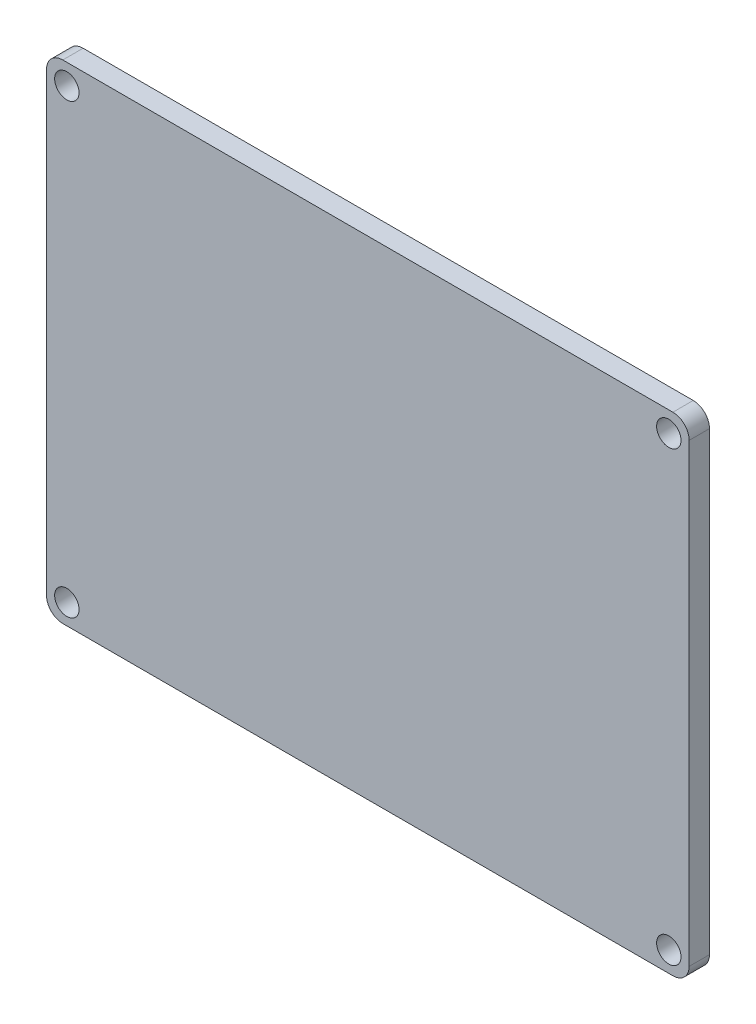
ISO-10303-21;
HEADER;
FILE_DESCRIPTION(('STEP AP214'),'2;1');
FILE_NAME('part.step','',(''),(''),'','','');
FILE_SCHEMA(('AUTOMOTIVE_DESIGN { 1 0 10303 214 1 1 1 1 }'));
ENDSEC;
DATA;
#1=APPLICATION_CONTEXT('core data for automotive mechanical design processes');
#2=APPLICATION_PROTOCOL_DEFINITION('international standard','automotive_design',2000,#1);
#3=PRODUCT_CONTEXT('',#1,'mechanical');
#4=PRODUCT('Part','Part','',(#3));
#5=PRODUCT_RELATED_PRODUCT_CATEGORY('part','',(#4));
#6=PRODUCT_DEFINITION_FORMATION('','',#4);
#7=PRODUCT_DEFINITION_CONTEXT('part definition',#1,'design');
#8=PRODUCT_DEFINITION('design','',#6,#7);
#9=PRODUCT_DEFINITION_SHAPE('','',#8);
#10=(LENGTH_UNIT() NAMED_UNIT(*) SI_UNIT(.MILLI.,.METRE.));
#11=(NAMED_UNIT(*) PLANE_ANGLE_UNIT() SI_UNIT($,.RADIAN.));
#12=(NAMED_UNIT(*) SI_UNIT($,.STERADIAN.) SOLID_ANGLE_UNIT());
#13=UNCERTAINTY_MEASURE_WITH_UNIT(LENGTH_MEASURE(1.E-05),#10,'distance_accuracy_value','');
#14=(GEOMETRIC_REPRESENTATION_CONTEXT(3) GLOBAL_UNCERTAINTY_ASSIGNED_CONTEXT((#13)) GLOBAL_UNIT_ASSIGNED_CONTEXT((#10,
#11,#12)) REPRESENTATION_CONTEXT('',''));
#15=CARTESIAN_POINT('',(0.,0.,0.));
#16=DIRECTION('',(0.,0.,1.));
#17=DIRECTION('',(1.,0.,0.));
#18=AXIS2_PLACEMENT_3D('',#15,#16,#17);
#19=CARTESIAN_POINT('',(0.,0.,3.175));
#20=DIRECTION('',(0.,0.,1.));
#21=DIRECTION('',(1.,0.,0.));
#22=AXIS2_PLACEMENT_3D('',#19,#20,#21);
#23=PLANE('',#22);
#24=CARTESIAN_POINT('',(46.99,-34.925,3.175));
#25=DIRECTION('',(0.,0.,1.));
#26=DIRECTION('',(1.,0.,0.));
#27=AXIS2_PLACEMENT_3D('',#24,#25,#26);
#28=CIRCLE('',#27,1.905);
#29=CARTESIAN_POINT('',(48.895,-34.925,3.175));
#30=VERTEX_POINT('',#29);
#31=EDGE_CURVE('E187',#30,#30,#28,.T.);
#32=ORIENTED_EDGE('',*,*,#31,.F.);
#33=EDGE_LOOP('',(#32));
#34=FACE_BOUND('',#33,.T.);
#35=CARTESIAN_POINT('',(-46.99,34.925,3.175));
#36=DIRECTION('',(0.,0.,1.));
#37=DIRECTION('',(1.,0.,0.));
#38=AXIS2_PLACEMENT_3D('',#35,#36,#37);
#39=CIRCLE('',#38,1.905);
#40=CARTESIAN_POINT('',(-45.085,34.925,3.175));
#41=VERTEX_POINT('',#40);
#42=EDGE_CURVE('E177',#41,#41,#39,.T.);
#43=ORIENTED_EDGE('',*,*,#42,.F.);
#44=EDGE_LOOP('',(#43));
#45=FACE_BOUND('',#44,.T.);
#46=DIRECTION('',(-1.,0.,0.));
#47=VECTOR('',#46,1.);
#48=CARTESIAN_POINT('',(-50.165,38.1,3.175));
#49=LINE('',#48,#47);
#50=CARTESIAN_POINT('',(47.625,38.1,3.175));
#51=VERTEX_POINT('',#50);
#52=CARTESIAN_POINT('',(-47.625,38.1,3.175));
#53=VERTEX_POINT('',#52);
#54=EDGE_CURVE('E168',#51,#53,#49,.T.);
#55=ORIENTED_EDGE('',*,*,#54,.T.);
#56=CARTESIAN_POINT('',(-47.625,35.56,3.175));
#57=DIRECTION('',(0.,0.,1.));
#58=DIRECTION('',(1.,0.,0.));
#59=AXIS2_PLACEMENT_3D('',#56,#57,#58);
#60=CIRCLE('',#59,2.54);
#61=CARTESIAN_POINT('',(-50.165,35.56,3.175));
#62=VERTEX_POINT('',#61);
#63=EDGE_CURVE('E146',#53,#62,#60,.T.);
#64=ORIENTED_EDGE('',*,*,#63,.T.);
#65=DIRECTION('',(0.,-1.,0.));
#66=VECTOR('',#65,1.);
#67=CARTESIAN_POINT('',(-50.165,38.1,3.175));
#68=LINE('',#67,#66);
#69=CARTESIAN_POINT('',(-50.165,-35.56,3.175));
#70=VERTEX_POINT('',#69);
#71=EDGE_CURVE('E116',#62,#70,#68,.T.);
#72=ORIENTED_EDGE('',*,*,#71,.T.);
#73=CARTESIAN_POINT('',(-47.625,-35.56,3.175));
#74=DIRECTION('',(0.,0.,1.));
#75=DIRECTION('',(1.,0.,0.));
#76=AXIS2_PLACEMENT_3D('',#73,#74,#75);
#77=CIRCLE('',#76,2.54);
#78=CARTESIAN_POINT('',(-47.625,-38.1,3.175));
#79=VERTEX_POINT('',#78);
#80=EDGE_CURVE('E52',#70,#79,#77,.T.);
#81=ORIENTED_EDGE('',*,*,#80,.T.);
#82=DIRECTION('',(1.,0.,0.));
#83=VECTOR('',#82,1.);
#84=CARTESIAN_POINT('',(-50.165,-38.1,3.175));
#85=LINE('',#84,#83);
#86=CARTESIAN_POINT('',(47.625,-38.1,3.175));
#87=VERTEX_POINT('',#86);
#88=EDGE_CURVE('E132',#79,#87,#85,.T.);
#89=ORIENTED_EDGE('',*,*,#88,.T.);
#90=CARTESIAN_POINT('',(47.625,-35.56,3.175));
#91=DIRECTION('',(0.,0.,1.));
#92=DIRECTION('',(1.,0.,0.));
#93=AXIS2_PLACEMENT_3D('',#90,#91,#92);
#94=CIRCLE('',#93,2.54);
#95=CARTESIAN_POINT('',(50.165,-35.56,3.175));
#96=VERTEX_POINT('',#95);
#97=EDGE_CURVE('E142',#87,#96,#94,.T.);
#98=ORIENTED_EDGE('',*,*,#97,.T.);
#99=DIRECTION('',(0.,1.,0.));
#100=VECTOR('',#99,1.);
#101=CARTESIAN_POINT('',(50.165,38.1,3.175));
#102=LINE('',#101,#100);
#103=CARTESIAN_POINT('',(50.165,35.56,3.175));
#104=VERTEX_POINT('',#103);
#105=EDGE_CURVE('E126',#96,#104,#102,.T.);
#106=ORIENTED_EDGE('',*,*,#105,.T.);
#107=CARTESIAN_POINT('',(47.625,35.56,3.175));
#108=DIRECTION('',(0.,0.,1.));
#109=DIRECTION('',(1.,0.,0.));
#110=AXIS2_PLACEMENT_3D('',#107,#108,#109);
#111=CIRCLE('',#110,2.54);
#112=EDGE_CURVE('E144',#104,#51,#111,.T.);
#113=ORIENTED_EDGE('',*,*,#112,.T.);
#114=EDGE_LOOP('',(#55,#64,#72,#81,#89,#98,#106,#113));
#115=FACE_BOUND('',#114,.T.);
#116=CARTESIAN_POINT('',(-46.99,-34.925,3.175));
#117=DIRECTION('',(0.,0.,1.));
#118=DIRECTION('',(-1.,0.,0.));
#119=AXIS2_PLACEMENT_3D('',#116,#117,#118);
#120=CIRCLE('',#119,1.905);
#121=CARTESIAN_POINT('',(-48.895,-34.925,3.175));
#122=VERTEX_POINT('',#121);
#123=EDGE_CURVE('E182',#122,#122,#120,.T.);
#124=ORIENTED_EDGE('',*,*,#123,.F.);
#125=EDGE_LOOP('',(#124));
#126=FACE_BOUND('',#125,.T.);
#127=CARTESIAN_POINT('',(46.99,34.9249999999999,3.175));
#128=DIRECTION('',(0.,0.,1.));
#129=DIRECTION('',(-1.,0.,0.));
#130=AXIS2_PLACEMENT_3D('',#127,#128,#129);
#131=CIRCLE('',#130,1.905);
#132=CARTESIAN_POINT('',(45.085,34.9249999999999,3.175));
#133=VERTEX_POINT('',#132);
#134=EDGE_CURVE('E193',#133,#133,#131,.T.);
#135=ORIENTED_EDGE('',*,*,#134,.F.);
#136=EDGE_LOOP('',(#135));
#137=FACE_BOUND('',#136,.T.);
#138=ADVANCED_FACE('F32',(#34,#45,#115,#126,#137),#23,.T.);
#139=CARTESIAN_POINT('',(0.,0.,0.));
#140=DIRECTION('',(0.,0.,1.));
#141=DIRECTION('',(1.,0.,0.));
#142=AXIS2_PLACEMENT_3D('',#139,#140,#141);
#143=PLANE('',#142);
#144=DIRECTION('',(0.,-1.,0.));
#145=VECTOR('',#144,1.);
#146=CARTESIAN_POINT('',(-50.165,38.1,0.));
#147=LINE('',#146,#145);
#148=CARTESIAN_POINT('',(-50.165,35.56,0.));
#149=VERTEX_POINT('',#148);
#150=CARTESIAN_POINT('',(-50.165,-35.56,0.));
#151=VERTEX_POINT('',#150);
#152=EDGE_CURVE('E114',#149,#151,#147,.T.);
#153=ORIENTED_EDGE('',*,*,#152,.F.);
#154=CARTESIAN_POINT('',(-47.625,35.56,0.));
#155=DIRECTION('',(0.,0.,1.));
#156=DIRECTION('',(1.,0.,0.));
#157=AXIS2_PLACEMENT_3D('',#154,#155,#156);
#158=CIRCLE('',#157,2.54);
#159=CARTESIAN_POINT('',(-47.625,38.1,0.));
#160=VERTEX_POINT('',#159);
#161=EDGE_CURVE('E97',#149,#160,#158,.F.);
#162=ORIENTED_EDGE('',*,*,#161,.T.);
#163=DIRECTION('',(-1.,0.,0.));
#164=VECTOR('',#163,1.);
#165=CARTESIAN_POINT('',(-50.165,38.1,0.));
#166=LINE('',#165,#164);
#167=CARTESIAN_POINT('',(47.625,38.1,0.));
#168=VERTEX_POINT('',#167);
#169=EDGE_CURVE('E124',#168,#160,#166,.T.);
#170=ORIENTED_EDGE('',*,*,#169,.F.);
#171=CARTESIAN_POINT('',(47.625,35.56,0.));
#172=DIRECTION('',(0.,0.,1.));
#173=DIRECTION('',(1.,0.,0.));
#174=AXIS2_PLACEMENT_3D('',#171,#172,#173);
#175=CIRCLE('',#174,2.54);
#176=CARTESIAN_POINT('',(50.165,35.56,0.));
#177=VERTEX_POINT('',#176);
#178=EDGE_CURVE('E108',#168,#177,#175,.F.);
#179=ORIENTED_EDGE('',*,*,#178,.T.);
#180=DIRECTION('',(0.,1.,0.));
#181=VECTOR('',#180,1.);
#182=CARTESIAN_POINT('',(50.165,38.1,0.));
#183=LINE('',#182,#181);
#184=CARTESIAN_POINT('',(50.165,-35.56,0.));
#185=VERTEX_POINT('',#184);
#186=EDGE_CURVE('E128',#185,#177,#183,.T.);
#187=ORIENTED_EDGE('',*,*,#186,.F.);
#188=CARTESIAN_POINT('',(47.625,-35.56,0.));
#189=DIRECTION('',(0.,0.,1.));
#190=DIRECTION('',(1.,0.,0.));
#191=AXIS2_PLACEMENT_3D('',#188,#189,#190);
#192=CIRCLE('',#191,2.54);
#193=CARTESIAN_POINT('',(47.625,-38.1,0.));
#194=VERTEX_POINT('',#193);
#195=EDGE_CURVE('E135',#185,#194,#192,.F.);
#196=ORIENTED_EDGE('',*,*,#195,.T.);
#197=DIRECTION('',(1.,0.,0.));
#198=VECTOR('',#197,1.);
#199=CARTESIAN_POINT('',(-50.165,-38.1,0.));
#200=LINE('',#199,#198);
#201=CARTESIAN_POINT('',(-47.625,-38.1,0.));
#202=VERTEX_POINT('',#201);
#203=EDGE_CURVE('E123',#202,#194,#200,.T.);
#204=ORIENTED_EDGE('',*,*,#203,.F.);
#205=CARTESIAN_POINT('',(-47.625,-35.56,0.));
#206=DIRECTION('',(0.,0.,1.));
#207=DIRECTION('',(1.,0.,0.));
#208=AXIS2_PLACEMENT_3D('',#205,#206,#207);
#209=CIRCLE('',#208,2.54);
#210=EDGE_CURVE('E117',#202,#151,#209,.F.);
#211=ORIENTED_EDGE('',*,*,#210,.T.);
#212=EDGE_LOOP('',(#153,#162,#170,#179,#187,#196,#204,#211));
#213=FACE_BOUND('',#212,.T.);
#214=CARTESIAN_POINT('',(-46.99,34.925,0.));
#215=DIRECTION('',(0.,0.,1.));
#216=DIRECTION('',(1.,0.,0.));
#217=AXIS2_PLACEMENT_3D('',#214,#215,#216);
#218=CIRCLE('',#217,1.905);
#219=CARTESIAN_POINT('',(-45.085,34.925,0.));
#220=VERTEX_POINT('',#219);
#221=EDGE_CURVE('E173',#220,#220,#218,.T.);
#222=ORIENTED_EDGE('',*,*,#221,.T.);
#223=EDGE_LOOP('',(#222));
#224=FACE_BOUND('',#223,.T.);
#225=CARTESIAN_POINT('',(-46.99,-34.925,0.));
#226=DIRECTION('',(0.,0.,1.));
#227=DIRECTION('',(-1.,0.,0.));
#228=AXIS2_PLACEMENT_3D('',#225,#226,#227);
#229=CIRCLE('',#228,1.905);
#230=CARTESIAN_POINT('',(-48.895,-34.925,0.));
#231=VERTEX_POINT('',#230);
#232=EDGE_CURVE('E184',#231,#231,#229,.T.);
#233=ORIENTED_EDGE('',*,*,#232,.T.);
#234=EDGE_LOOP('',(#233));
#235=FACE_BOUND('',#234,.T.);
#236=CARTESIAN_POINT('',(46.99,-34.925,0.));
#237=DIRECTION('',(0.,0.,1.));
#238=DIRECTION('',(1.,0.,0.));
#239=AXIS2_PLACEMENT_3D('',#236,#237,#238);
#240=CIRCLE('',#239,1.905);
#241=CARTESIAN_POINT('',(48.895,-34.925,0.));
#242=VERTEX_POINT('',#241);
#243=EDGE_CURVE('E190',#242,#242,#240,.T.);
#244=ORIENTED_EDGE('',*,*,#243,.T.);
#245=EDGE_LOOP('',(#244));
#246=FACE_BOUND('',#245,.T.);
#247=CARTESIAN_POINT('',(46.99,34.9249999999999,0.));
#248=DIRECTION('',(0.,0.,1.));
#249=DIRECTION('',(-1.,0.,0.));
#250=AXIS2_PLACEMENT_3D('',#247,#248,#249);
#251=CIRCLE('',#250,1.905);
#252=CARTESIAN_POINT('',(45.085,34.9249999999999,0.));
#253=VERTEX_POINT('',#252);
#254=EDGE_CURVE('E196',#253,#253,#251,.T.);
#255=ORIENTED_EDGE('',*,*,#254,.T.);
#256=EDGE_LOOP('',(#255));
#257=FACE_BOUND('',#256,.T.);
#258=ADVANCED_FACE('F120',(#213,#224,#235,#246,#257),#143,.F.);
#259=CARTESIAN_POINT('',(50.165,38.1,3.175));
#260=DIRECTION('',(-1.,0.,0.));
#261=DIRECTION('',(0.,-1.,0.));
#262=AXIS2_PLACEMENT_3D('',#259,#260,#261);
#263=PLANE('',#262);
#264=ORIENTED_EDGE('',*,*,#186,.T.);
#265=DIRECTION('',(0.,0.,-1.));
#266=VECTOR('',#265,1.);
#267=CARTESIAN_POINT('',(50.165,35.56,3.175));
#268=LINE('',#267,#266);
#269=EDGE_CURVE('E151',#177,#104,#268,.F.);
#270=ORIENTED_EDGE('',*,*,#269,.T.);
#271=ORIENTED_EDGE('',*,*,#105,.F.);
#272=DIRECTION('',(0.,0.,-1.));
#273=VECTOR('',#272,1.);
#274=CARTESIAN_POINT('',(50.165,-35.56,3.175));
#275=LINE('',#274,#273);
#276=EDGE_CURVE('E148',#96,#185,#275,.T.);
#277=ORIENTED_EDGE('',*,*,#276,.T.);
#278=EDGE_LOOP('',(#264,#270,#271,#277));
#279=FACE_BOUND('',#278,.T.);
#280=ADVANCED_FACE('F164',(#279),#263,.F.);
#281=CARTESIAN_POINT('',(-50.165,38.1,3.175));
#282=DIRECTION('',(0.,-1.,0.));
#283=DIRECTION('',(0.,0.,-1.));
#284=AXIS2_PLACEMENT_3D('',#281,#282,#283);
#285=PLANE('',#284);
#286=ORIENTED_EDGE('',*,*,#169,.T.);
#287=DIRECTION('',(0.,0.,-1.));
#288=VECTOR('',#287,1.);
#289=CARTESIAN_POINT('',(-47.625,38.1,3.175));
#290=LINE('',#289,#288);
#291=EDGE_CURVE('E102',#160,#53,#290,.F.);
#292=ORIENTED_EDGE('',*,*,#291,.T.);
#293=ORIENTED_EDGE('',*,*,#54,.F.);
#294=DIRECTION('',(0.,0.,-1.));
#295=VECTOR('',#294,1.);
#296=CARTESIAN_POINT('',(47.625,38.1,3.175));
#297=LINE('',#296,#295);
#298=EDGE_CURVE('E107',#51,#168,#297,.T.);
#299=ORIENTED_EDGE('',*,*,#298,.T.);
#300=EDGE_LOOP('',(#286,#292,#293,#299));
#301=FACE_BOUND('',#300,.T.);
#302=ADVANCED_FACE('F222',(#301),#285,.F.);
#303=CARTESIAN_POINT('',(-50.165,38.1,3.175));
#304=DIRECTION('',(1.,0.,0.));
#305=DIRECTION('',(0.,0.,-1.));
#306=AXIS2_PLACEMENT_3D('',#303,#304,#305);
#307=PLANE('',#306);
#308=ORIENTED_EDGE('',*,*,#71,.F.);
#309=DIRECTION('',(0.,0.,-1.));
#310=VECTOR('',#309,1.);
#311=CARTESIAN_POINT('',(-50.165,35.56,3.175));
#312=LINE('',#311,#310);
#313=EDGE_CURVE('E101',#62,#149,#312,.T.);
#314=ORIENTED_EDGE('',*,*,#313,.T.);
#315=ORIENTED_EDGE('',*,*,#152,.T.);
#316=DIRECTION('',(0.,0.,-1.));
#317=VECTOR('',#316,1.);
#318=CARTESIAN_POINT('',(-50.165,-35.56,3.175));
#319=LINE('',#318,#317);
#320=EDGE_CURVE('E118',#151,#70,#319,.F.);
#321=ORIENTED_EDGE('',*,*,#320,.T.);
#322=EDGE_LOOP('',(#308,#314,#315,#321));
#323=FACE_BOUND('',#322,.T.);
#324=ADVANCED_FACE('F113',(#323),#307,.F.);
#325=CARTESIAN_POINT('',(-50.165,-38.1,3.175));
#326=DIRECTION('',(0.,1.,0.));
#327=DIRECTION('',(0.,0.,1.));
#328=AXIS2_PLACEMENT_3D('',#325,#326,#327);
#329=PLANE('',#328);
#330=ORIENTED_EDGE('',*,*,#203,.T.);
#331=DIRECTION('',(0.,0.,-1.));
#332=VECTOR('',#331,1.);
#333=CARTESIAN_POINT('',(47.625,-38.1,3.175));
#334=LINE('',#333,#332);
#335=EDGE_CURVE('E11',#194,#87,#334,.F.);
#336=ORIENTED_EDGE('',*,*,#335,.T.);
#337=ORIENTED_EDGE('',*,*,#88,.F.);
#338=DIRECTION('',(0.,0.,-1.));
#339=VECTOR('',#338,1.);
#340=CARTESIAN_POINT('',(-47.625,-38.1,3.175));
#341=LINE('',#340,#339);
#342=EDGE_CURVE('E40',#79,#202,#341,.T.);
#343=ORIENTED_EDGE('',*,*,#342,.T.);
#344=EDGE_LOOP('',(#330,#336,#337,#343));
#345=FACE_BOUND('',#344,.T.);
#346=ADVANCED_FACE('F154',(#345),#329,.F.);
#347=CARTESIAN_POINT('',(-46.99,34.925,3.175));
#348=DIRECTION('',(0.,0.,-1.));
#349=DIRECTION('',(-1.,0.,0.));
#350=AXIS2_PLACEMENT_3D('',#347,#348,#349);
#351=CYLINDRICAL_SURFACE('',#350,1.905);
#352=ORIENTED_EDGE('',*,*,#42,.T.);
#353=EDGE_LOOP('',(#352));
#354=FACE_BOUND('',#353,.T.);
#355=ORIENTED_EDGE('',*,*,#221,.F.);
#356=EDGE_LOOP('',(#355));
#357=FACE_BOUND('',#356,.T.);
#358=ADVANCED_FACE('F215',(#354,#357),#351,.F.);
#359=CARTESIAN_POINT('',(-46.99,-34.925,3.175));
#360=DIRECTION('',(0.,0.,-1.));
#361=DIRECTION('',(-1.,0.,0.));
#362=AXIS2_PLACEMENT_3D('',#359,#360,#361);
#363=CYLINDRICAL_SURFACE('',#362,1.905);
#364=ORIENTED_EDGE('',*,*,#123,.T.);
#365=EDGE_LOOP('',(#364));
#366=FACE_BOUND('',#365,.T.);
#367=ORIENTED_EDGE('',*,*,#232,.F.);
#368=EDGE_LOOP('',(#367));
#369=FACE_BOUND('',#368,.T.);
#370=ADVANCED_FACE('F244',(#366,#369),#363,.F.);
#371=CARTESIAN_POINT('',(46.99,-34.925,3.175));
#372=DIRECTION('',(0.,0.,-1.));
#373=DIRECTION('',(-1.,0.,0.));
#374=AXIS2_PLACEMENT_3D('',#371,#372,#373);
#375=CYLINDRICAL_SURFACE('',#374,1.905);
#376=ORIENTED_EDGE('',*,*,#31,.T.);
#377=EDGE_LOOP('',(#376));
#378=FACE_BOUND('',#377,.T.);
#379=ORIENTED_EDGE('',*,*,#243,.F.);
#380=EDGE_LOOP('',(#379));
#381=FACE_BOUND('',#380,.T.);
#382=ADVANCED_FACE('F247',(#378,#381),#375,.F.);
#383=CARTESIAN_POINT('',(46.99,34.9249999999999,3.175));
#384=DIRECTION('',(0.,0.,-1.));
#385=DIRECTION('',(-1.,0.,0.));
#386=AXIS2_PLACEMENT_3D('',#383,#384,#385);
#387=CYLINDRICAL_SURFACE('',#386,1.905);
#388=ORIENTED_EDGE('',*,*,#134,.T.);
#389=EDGE_LOOP('',(#388));
#390=FACE_BOUND('',#389,.T.);
#391=ORIENTED_EDGE('',*,*,#254,.F.);
#392=EDGE_LOOP('',(#391));
#393=FACE_BOUND('',#392,.T.);
#394=ADVANCED_FACE('F202',(#390,#393),#387,.F.);
#395=CARTESIAN_POINT('',(-47.625,35.56,3.175));
#396=DIRECTION('',(0.,0.,-1.));
#397=DIRECTION('',(-1.,0.,0.));
#398=AXIS2_PLACEMENT_3D('',#395,#396,#397);
#399=CYLINDRICAL_SURFACE('',#398,2.54);
#400=ORIENTED_EDGE('',*,*,#63,.F.);
#401=ORIENTED_EDGE('',*,*,#291,.F.);
#402=ORIENTED_EDGE('',*,*,#161,.F.);
#403=ORIENTED_EDGE('',*,*,#313,.F.);
#404=EDGE_LOOP('',(#400,#401,#402,#403));
#405=FACE_BOUND('',#404,.T.);
#406=ADVANCED_FACE('F100',(#405),#399,.T.);
#407=CARTESIAN_POINT('',(47.625,35.56,3.175));
#408=DIRECTION('',(0.,0.,-1.));
#409=DIRECTION('',(-1.,0.,0.));
#410=AXIS2_PLACEMENT_3D('',#407,#408,#409);
#411=CYLINDRICAL_SURFACE('',#410,2.54);
#412=ORIENTED_EDGE('',*,*,#112,.F.);
#413=ORIENTED_EDGE('',*,*,#269,.F.);
#414=ORIENTED_EDGE('',*,*,#178,.F.);
#415=ORIENTED_EDGE('',*,*,#298,.F.);
#416=EDGE_LOOP('',(#412,#413,#414,#415));
#417=FACE_BOUND('',#416,.T.);
#418=ADVANCED_FACE('F230',(#417),#411,.T.);
#419=CARTESIAN_POINT('',(47.625,-35.56,3.175));
#420=DIRECTION('',(0.,0.,-1.));
#421=DIRECTION('',(-1.,0.,0.));
#422=AXIS2_PLACEMENT_3D('',#419,#420,#421);
#423=CYLINDRICAL_SURFACE('',#422,2.54);
#424=ORIENTED_EDGE('',*,*,#97,.F.);
#425=ORIENTED_EDGE('',*,*,#335,.F.);
#426=ORIENTED_EDGE('',*,*,#195,.F.);
#427=ORIENTED_EDGE('',*,*,#276,.F.);
#428=EDGE_LOOP('',(#424,#425,#426,#427));
#429=FACE_BOUND('',#428,.T.);
#430=ADVANCED_FACE('F161',(#429),#423,.T.);
#431=CARTESIAN_POINT('',(-47.625,-35.56,3.175));
#432=DIRECTION('',(0.,0.,-1.));
#433=DIRECTION('',(-1.,0.,0.));
#434=AXIS2_PLACEMENT_3D('',#431,#432,#433);
#435=CYLINDRICAL_SURFACE('',#434,2.54);
#436=ORIENTED_EDGE('',*,*,#80,.F.);
#437=ORIENTED_EDGE('',*,*,#320,.F.);
#438=ORIENTED_EDGE('',*,*,#210,.F.);
#439=ORIENTED_EDGE('',*,*,#342,.F.);
#440=EDGE_LOOP('',(#436,#437,#438,#439));
#441=FACE_BOUND('',#440,.T.);
#442=ADVANCED_FACE('F34',(#441),#435,.T.);
#443=CLOSED_SHELL('',(#138,#258,#280,#302,#324,#346,#358,#370,#382,#394,#406,#418,#430,#442));
#444=MANIFOLD_SOLID_BREP('B2',#443);
#445=ADVANCED_BREP_SHAPE_REPRESENTATION('',(#18,#444),#14);
#446=SHAPE_DEFINITION_REPRESENTATION(#9,#445);
ENDSEC;
END-ISO-10303-21;
